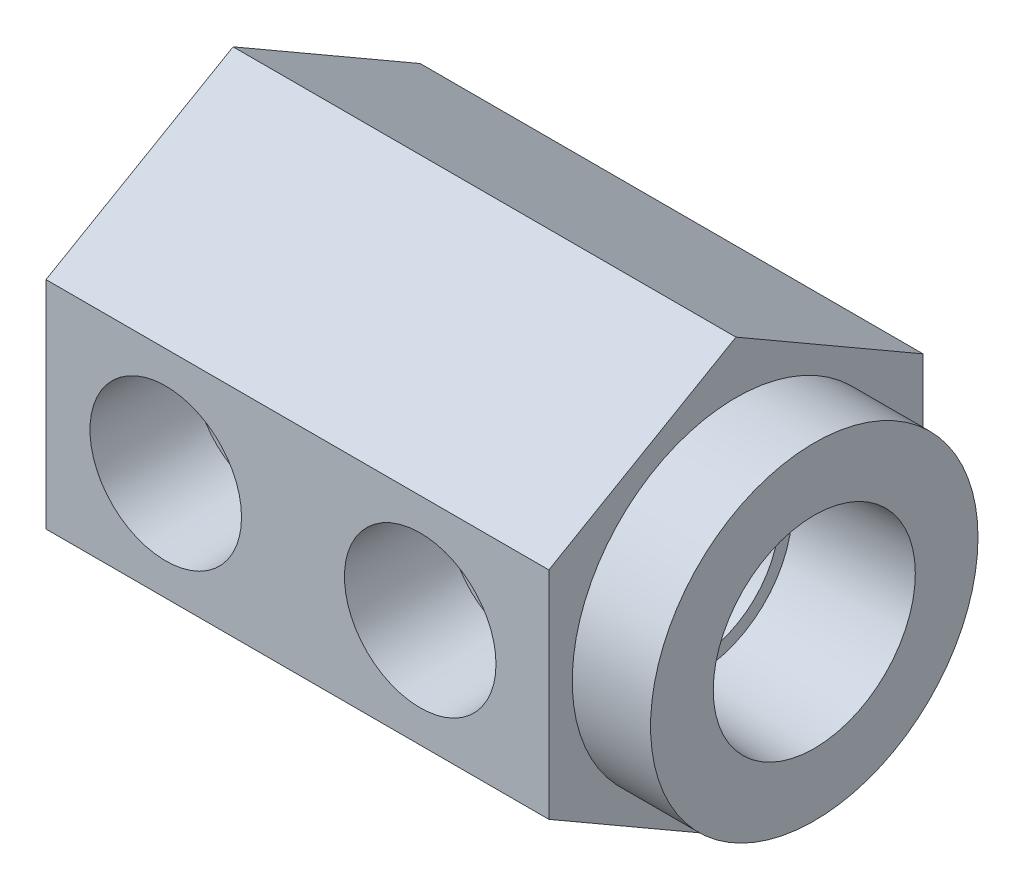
from build123d import *

# Parameters (mm, degrees)
BOSS_EXTRUDE1_DEPTH                 = 34.13125
SKETCH2_R                           = 11.1125
BOSS_EXTRUDE2_DEPTH                 = 5.31622
F_1_8_NPT_TAPPED_HOLE1_AT_2_COUNT   = 2
F_1_8_NPT_TAPPED_HOLE1_AT_2_PITCH   = 17.272
F_1_4_0_25_DIAMETER_HOLE1_D         = 6.35
F_1_4_0_25_DIAMETER_HOLE1_DEPTH     = 25.4
F_1_4_0_25_DIAMETER_HOLE1_TIP       = 1.907732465
F_7_32_0_21875_DIAMETER_HOLE1_D     = 5.55625
F_7_32_0_21875_DIAMETER_HOLE1_DEPTH = 31.75
F_7_32_0_21875_DIAMETER_HOLE1_TIP   = 1.669265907


with BuildPart() as part:
    # Sketch1 → Boss-Extrude1 (new body)
    with BuildSketch(Plane(origin=(0, 0, 0), x_dir=(0, 0, -1), z_dir=(1, 0, 0))):
        Polygon((-12.7, -7.332348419), (0, -14.664696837), (12.7, -7.332348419), (12.7, 7.332348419), (0, 14.664696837), (-12.7, 7.332348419), align=None)
    extrude(amount=BOSS_EXTRUDE1_DEPTH)

    # Sketch2 → Boss-Extrude2 (add)
    with BuildSketch(Plane(origin=(34.13125, 0, 0), x_dir=(0, 0, -1), z_dir=(1, 0, 0))):
        Circle(SKETCH2_R)
    extrude(amount=BOSS_EXTRUDE2_DEPTH)

    # Sketch3 → Cut-Revolve1 (revolve, cut)
    with BuildSketch(Plane.XY, mode=Mode.PRIVATE) as cut_revolve1_sk:
        Polygon((39.44747, 6.858066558), (31.50997, 6.44207981), (31.50997, 5.55625), (21.03247, 5.55625), (21.03247, 0), (39.44747, 0), align=None)
    revolve(cut_revolve1_sk.sketch.rotate(Axis((0, 0, 0), (1, 0, 0)), 90), axis=Axis((0, 0, 0), (1, 0, 0)), mode=Mode.SUBTRACT)

    # Sketch4 → 1_8 NPT Tapped Hole1 (revolve, cut)
    with BuildSketch(Plane(origin=(8.128, 0, 12.7), x_dir=(0, -1, 0), z_dir=(1, 0, 0))):
        Polygon((0, 0), (0, 14.156508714), (4.2164, 11.62304), (4.2164, 6.92404), (4.93618497, 6.92404), (5.1435, 0), align=None)
    f_1_8_npt_tapped_hole1 = revolve(axis=Axis((8.128, 0, 19.05), (0, 0, -1)), mode=Mode.SUBTRACT)

    # 1_8 NPT Tapped Hole1 at 2: 1_8 NPT Tapped Hole1 ×2
    with Locations(*[(i * F_1_8_NPT_TAPPED_HOLE1_AT_2_PITCH, 0, 0) for i in range(1, F_1_8_NPT_TAPPED_HOLE1_AT_2_COUNT)]):
        add(f_1_8_npt_tapped_hole1, mode=Mode.SUBTRACT)

    # Sketch6 → 1_8 NPT Tapped Hole2 (revolve, cut)
    with BuildSketch(Plane(origin=(8.128, 0, -12.7), x_dir=(0, 1, 0), z_dir=(1, 0, 0))):
        Polygon((0, 0), (0, 18.408468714), (4.2164, 15.875), (4.2164, 6.92404), (4.93618497, 6.92404), (5.1435, 0), align=None)
    revolve(axis=Axis((8.128, 0, -19.05), (0, 0, 1)), mode=Mode.SUBTRACT)

    # 1_4 _0.25_ Diameter Hole1
    with Locations(Plane(origin=(39.44747, 0, 0), x_dir=(0, 0, -1), z_dir=(1, 0, 0))):
        with Locations((0, 0)):
            Hole(F_1_4_0_25_DIAMETER_HOLE1_D / 2, depth=F_1_4_0_25_DIAMETER_HOLE1_DEPTH)
            with Locations((0, 0, -(F_1_4_0_25_DIAMETER_HOLE1_DEPTH + F_1_4_0_25_DIAMETER_HOLE1_TIP / 2))):  # 118° drill point
                Cone(0, F_1_4_0_25_DIAMETER_HOLE1_D / 2, F_1_4_0_25_DIAMETER_HOLE1_TIP, mode=Mode.SUBTRACT)

    # 7_32 _0.21875_ Diameter Hole1
    with Locations(Plane(origin=(39.44747, 0, 0), x_dir=(0, 0, -1), z_dir=(1, 0, 0))):
        with Locations((0, 0)):
            Hole(F_7_32_0_21875_DIAMETER_HOLE1_D / 2, depth=F_7_32_0_21875_DIAMETER_HOLE1_DEPTH)
            with Locations((0, 0, -(F_7_32_0_21875_DIAMETER_HOLE1_DEPTH + F_7_32_0_21875_DIAMETER_HOLE1_TIP / 2))):  # 118° drill point
                Cone(0, F_7_32_0_21875_DIAMETER_HOLE1_D / 2, F_7_32_0_21875_DIAMETER_HOLE1_TIP, mode=Mode.SUBTRACT)


solid = part.part
